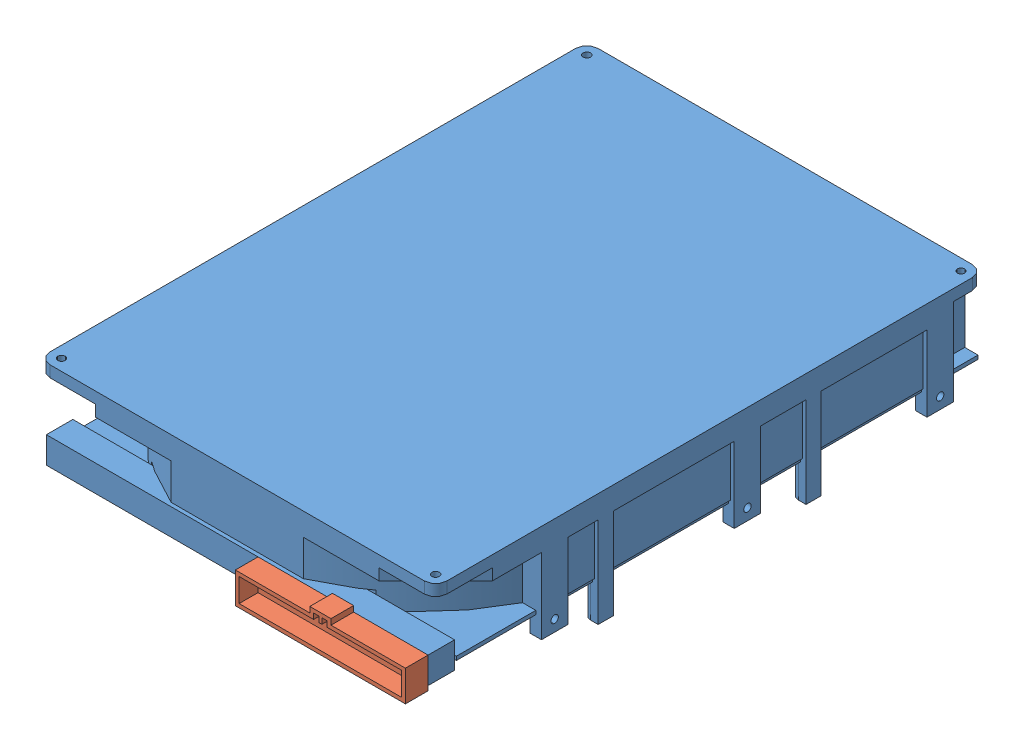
SolidWorks assembly FF_Disk_Drvie.SLDASM, configuration Default (file format 13000). Lengths in mm.
Overall size (105 30 151).
2 component instances, 2 part files, 3 mates.
Components (placement in the parent):
- FF_Disk_Drive_Body-2: FF_Disk_Drive_Body.SLDPRT [Default] at origin size (105 30 145)
- FF_3-36 Female Connector-2: FF_3-36 Female Connector.SLDPRT [Default] at (28 -0.6 78.5) x (-1 0 0) z (0 0 -1) size (45 9.7 6)
Mates (geometry in assembly coordinates):
- Coincident1: coincident: plane of FF_3-36 Female Connector-2 through (25.2 3.5 72.5) normal (0 0 -1); plane of FF_Disk_Drive_Body-2 through (-52.5 20 72.5) normal (0 0 1)
- Coincident2: coincident: plane of FF_Disk_Drive_Body-2 through (50.5 3.5 65.5) normal (1 0 0); plane of FF_3-36 Female Connector-2 through (50.5 -3.7 72.5) normal (1 0 0)
- Coincident3: coincident: plane of FF_Disk_Drive_Body-2 through (0 3.5 65.5) normal (0 1 0); plane of FF_3-36 Female Connector-2 through (49.5 3.5 72.5) normal (0 1 0)
